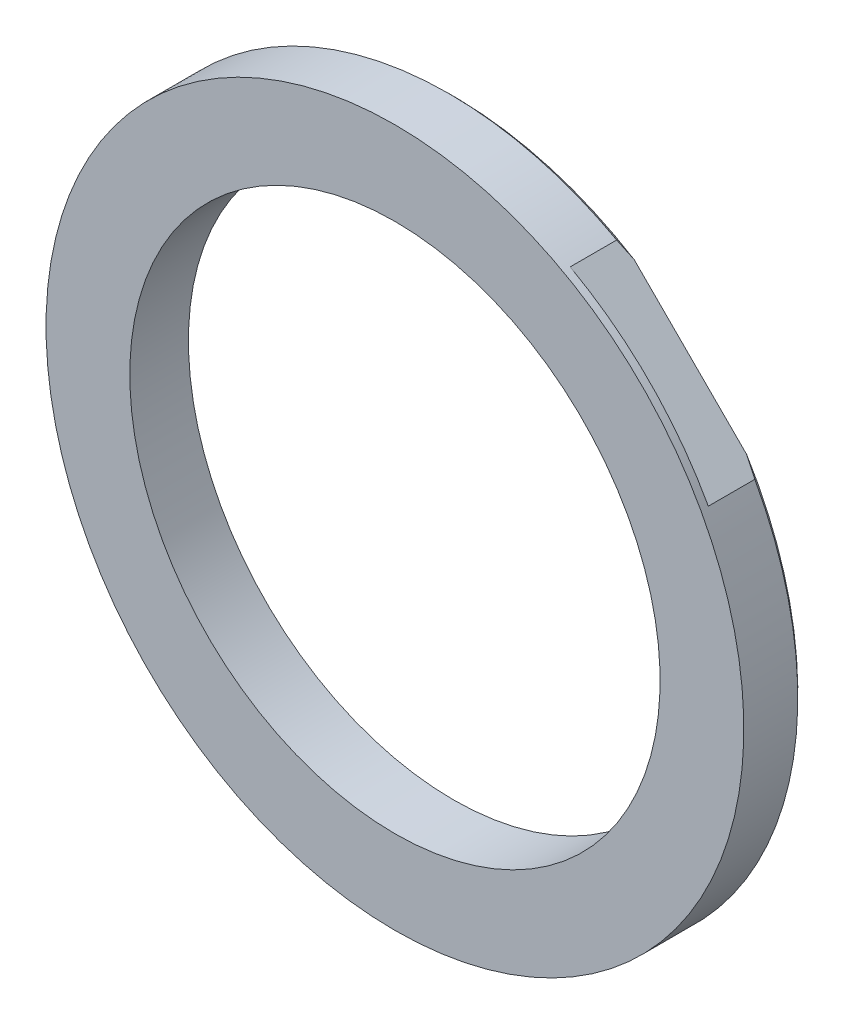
ISO-10303-21;
HEADER;
FILE_DESCRIPTION(('STEP AP214'),'2;1');
FILE_NAME('part.step','',(''),(''),'','','');
FILE_SCHEMA(('AUTOMOTIVE_DESIGN { 1 0 10303 214 1 1 1 1 }'));
ENDSEC;
DATA;
#1=APPLICATION_CONTEXT('core data for automotive mechanical design processes');
#2=APPLICATION_PROTOCOL_DEFINITION('international standard','automotive_design',2000,#1);
#3=PRODUCT_CONTEXT('',#1,'mechanical');
#4=PRODUCT('Part','Part','',(#3));
#5=PRODUCT_RELATED_PRODUCT_CATEGORY('part','',(#4));
#6=PRODUCT_DEFINITION_FORMATION('','',#4);
#7=PRODUCT_DEFINITION_CONTEXT('part definition',#1,'design');
#8=PRODUCT_DEFINITION('design','',#6,#7);
#9=PRODUCT_DEFINITION_SHAPE('','',#8);
#10=(LENGTH_UNIT() NAMED_UNIT(*) SI_UNIT(.MILLI.,.METRE.));
#11=(NAMED_UNIT(*) PLANE_ANGLE_UNIT() SI_UNIT($,.RADIAN.));
#12=(NAMED_UNIT(*) SI_UNIT($,.STERADIAN.) SOLID_ANGLE_UNIT());
#13=UNCERTAINTY_MEASURE_WITH_UNIT(LENGTH_MEASURE(1.E-05),#10,'distance_accuracy_value','');
#14=(GEOMETRIC_REPRESENTATION_CONTEXT(3) GLOBAL_UNCERTAINTY_ASSIGNED_CONTEXT((#13)) GLOBAL_UNIT_ASSIGNED_CONTEXT((#10,
#11,#12)) REPRESENTATION_CONTEXT('',''));
#15=CARTESIAN_POINT('',(0.,0.,0.));
#16=DIRECTION('',(0.,0.,1.));
#17=DIRECTION('',(1.,0.,0.));
#18=AXIS2_PLACEMENT_3D('',#15,#16,#17);
#19=CARTESIAN_POINT('',(-800.,0.,990.));
#20=DIRECTION('',(0.,0.,-1.));
#21=DIRECTION('',(0.,1.,0.));
#22=AXIS2_PLACEMENT_3D('',#19,#20,#21);
#23=PLANE('',#22);
#24=CARTESIAN_POINT('',(-800.,0.,990.));
#25=DIRECTION('',(0.,0.,1.));
#26=DIRECTION('',(1.,0.,0.));
#27=AXIS2_PLACEMENT_3D('',#24,#25,#26);
#28=CIRCLE('',#27,37.0000000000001);
#29=CARTESIAN_POINT('',(-819.414321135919,-31.4973671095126,990.));
#30=VERTEX_POINT('',#29);
#31=CARTESIAN_POINT('',(-768.502632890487,19.4143211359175,990.));
#32=VERTEX_POINT('',#31);
#33=EDGE_CURVE('E78',#30,#32,#28,.T.);
#34=ORIENTED_EDGE('',*,*,#33,.F.);
#35=DIRECTION('',(-0.707106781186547,0.707106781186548,0.));
#36=VECTOR('',#35,1.);
#37=CARTESIAN_POINT('',(-832.880465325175,-18.031222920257,990.));
#38=LINE('',#37,#36);
#39=CARTESIAN_POINT('',(-831.497367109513,-19.4143211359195,990.));
#40=VERTEX_POINT('',#39);
#41=EDGE_CURVE('E83',#30,#40,#38,.T.);
#42=ORIENTED_EDGE('',*,*,#41,.T.);
#43=CARTESIAN_POINT('',(-800.,0.,990.));
#44=DIRECTION('',(0.,0.,1.));
#45=DIRECTION('',(0.,-1.,0.));
#46=AXIS2_PLACEMENT_3D('',#43,#44,#45);
#47=CIRCLE('',#46,36.9999999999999);
#48=CARTESIAN_POINT('',(-780.585678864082,31.4973671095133,990.));
#49=VERTEX_POINT('',#48);
#50=EDGE_CURVE('E19',#49,#40,#47,.T.);
#51=ORIENTED_EDGE('',*,*,#50,.F.);
#52=DIRECTION('',(0.707106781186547,-0.707106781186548,0.));
#53=VECTOR('',#52,1.);
#54=CARTESIAN_POINT('',(-767.119534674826,18.031222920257,990.));
#55=LINE('',#54,#53);
#56=EDGE_CURVE('E67',#49,#32,#55,.T.);
#57=ORIENTED_EDGE('',*,*,#56,.T.);
#58=EDGE_LOOP('',(#34,#42,#51,#57));
#59=FACE_BOUND('',#58,.T.);
#60=CARTESIAN_POINT('',(-800.,0.,990.));
#61=DIRECTION('',(0.,0.,-1.));
#62=DIRECTION('',(0.,1.,0.));
#63=AXIS2_PLACEMENT_3D('',#60,#61,#62);
#64=CIRCLE('',#63,28.5);
#65=CARTESIAN_POINT('',(-800.,28.5,990.));
#66=VERTEX_POINT('',#65);
#67=EDGE_CURVE('E91',#66,#66,#64,.F.);
#68=ORIENTED_EDGE('',*,*,#67,.T.);
#69=EDGE_LOOP('',(#68));
#70=FACE_BOUND('',#69,.T.);
#71=ADVANCED_FACE('F16',(#59,#70),#23,.T.);
#72=CARTESIAN_POINT('',(-800.,0.,990.5));
#73=DIRECTION('',(0.,0.,1.));
#74=DIRECTION('',(0.,-1.,0.));
#75=AXIS2_PLACEMENT_3D('',#72,#73,#74);
#76=CONICAL_SURFACE('',#75,37.5000000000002,0.785398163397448);
#77=CARTESIAN_POINT('',(-781.968777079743,32.8804653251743,990.5));
#78=CARTESIAN_POINT('',(-781.854201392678,32.7658896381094,990.454630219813));
#79=CARTESIAN_POINT('',(-781.739447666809,32.6511359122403,990.410158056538));
#80=CARTESIAN_POINT('',(-781.509607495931,32.4212957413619,990.323056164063));
#81=CARTESIAN_POINT('',(-781.394521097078,32.3062093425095,990.280426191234));
#82=CARTESIAN_POINT('',(-781.164008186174,32.0756964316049,990.197043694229));
#83=CARTESIAN_POINT('',(-781.048581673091,31.9602699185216,990.156291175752));
#84=CARTESIAN_POINT('',(-780.81738318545,31.7290714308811,990.07669904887));
#85=CARTESIAN_POINT('',(-780.701611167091,31.6132994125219,990.037859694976));
#86=CARTESIAN_POINT('',(-780.585678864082,31.497367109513,990.));
#87=B_SPLINE_CURVE_WITH_KNOTS('',3,(#77,#78,#79,#80,#81,#82,#83,#84,#85,#86),.UNSPECIFIED.,.F.,
.F.,(4,2,2,2,4),(0.,0.504797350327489,1.0095277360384,1.51425965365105,2.01905853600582),.UNSPECIFIED.);
#88=CARTESIAN_POINT('',(-781.968777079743,32.8804653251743,990.5));
#89=VERTEX_POINT('',#88);
#90=EDGE_CURVE('E72',#89,#49,#87,.T.);
#91=ORIENTED_EDGE('',*,*,#90,.T.);
#92=ORIENTED_EDGE('',*,*,#50,.T.);
#93=CARTESIAN_POINT('',(-831.497367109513,-19.4143211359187,990.));
#94=CARTESIAN_POINT('',(-831.613299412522,-19.2983888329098,990.037859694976));
#95=CARTESIAN_POINT('',(-831.729071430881,-19.1826168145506,990.076699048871));
#96=CARTESIAN_POINT('',(-831.960269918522,-18.95141832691,990.156291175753));
#97=CARTESIAN_POINT('',(-832.075696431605,-18.8359918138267,990.19704369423));
#98=CARTESIAN_POINT('',(-832.30620934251,-18.605478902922,990.280426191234));
#99=CARTESIAN_POINT('',(-832.421295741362,-18.4903925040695,990.323056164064));
#100=CARTESIAN_POINT('',(-832.651135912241,-18.2605523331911,990.410158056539));
#101=CARTESIAN_POINT('',(-832.76588963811,-18.145798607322,990.454630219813));
#102=CARTESIAN_POINT('',(-832.880465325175,-18.0312229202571,990.5));
#103=B_SPLINE_CURVE_WITH_KNOTS('',3,(#93,#94,#95,#96,#97,#98,#99,#100,#101,#102),.UNSPECIFIED.,
.F.,.F.,(4,2,2,2,4),(0.,0.504798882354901,1.00953079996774,1.51426118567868,2.01905853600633),.UNSPECIFIED.);
#104=CARTESIAN_POINT('',(-832.880465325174,-18.0312229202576,990.5));
#105=VERTEX_POINT('',#104);
#106=EDGE_CURVE('E119',#40,#105,#103,.T.);
#107=ORIENTED_EDGE('',*,*,#106,.T.);
#108=CARTESIAN_POINT('',(-800.,0.,990.5));
#109=DIRECTION('',(0.,0.,-1.));
#110=DIRECTION('',(0.,1.,0.));
#111=AXIS2_PLACEMENT_3D('',#108,#109,#110);
#112=CIRCLE('',#111,37.5);
#113=EDGE_CURVE('E90',#89,#105,#112,.F.);
#114=ORIENTED_EDGE('',*,*,#113,.F.);
#115=EDGE_LOOP('',(#91,#92,#107,#114));
#116=FACE_BOUND('',#115,.T.);
#117=ADVANCED_FACE('F89',(#116),#76,.T.);
#118=CARTESIAN_POINT('',(-825.7757695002,-25.7757695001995,995.5));
#119=DIRECTION('',(0.,0.,1.));
#120=DIRECTION('',(0.,-1.,0.));
#121=AXIS2_PLACEMENT_3D('',#118,#119,#120);
#122=PLANE('',#121);
#123=CARTESIAN_POINT('',(-800.,0.,995.5));
#124=DIRECTION('',(0.,0.,-1.));
#125=DIRECTION('',(0.,1.,0.));
#126=AXIS2_PLACEMENT_3D('',#123,#124,#125);
#127=CIRCLE('',#126,37.5);
#128=CARTESIAN_POINT('',(-832.880465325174,-18.0312229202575,995.5));
#129=VERTEX_POINT('',#128);
#130=CARTESIAN_POINT('',(-818.031222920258,-32.8804653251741,995.5));
#131=VERTEX_POINT('',#130);
#132=EDGE_CURVE('E151',#129,#131,#127,.F.);
#133=ORIENTED_EDGE('',*,*,#132,.F.);
#134=DIRECTION('',(-0.707106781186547,0.707106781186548,0.));
#135=VECTOR('',#134,1.);
#136=CARTESIAN_POINT('',(-832.880465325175,-18.031222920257,995.5));
#137=LINE('',#136,#135);
#138=EDGE_CURVE('E87',#129,#131,#137,.F.);
#139=ORIENTED_EDGE('',*,*,#138,.T.);
#140=EDGE_LOOP('',(#133,#139));
#141=FACE_BOUND('',#140,.T.);
#142=ADVANCED_FACE('F116',(#141),#122,.F.);
#143=CARTESIAN_POINT('',(-832.880465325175,-18.031222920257,990.));
#144=DIRECTION('',(0.707106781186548,0.707106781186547,0.));
#145=DIRECTION('',(-0.707106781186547,0.707106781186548,0.));
#146=AXIS2_PLACEMENT_3D('',#143,#144,#145);
#147=PLANE('',#146);
#148=ORIENTED_EDGE('',*,*,#41,.F.);
#149=CARTESIAN_POINT('',(-819.414321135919,-31.4973671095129,990.));
#150=CARTESIAN_POINT('',(-819.356779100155,-31.5549097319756,990.018791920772));
#151=CARTESIAN_POINT('',(-819.299276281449,-31.6124128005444,990.037824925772));
#152=CARTESIAN_POINT('',(-819.184242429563,-31.7274467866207,990.076404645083));
#153=CARTESIAN_POINT('',(-819.126711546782,-31.7849775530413,990.095952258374));
#154=CARTESIAN_POINT('',(-819.011617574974,-31.9000712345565,990.135561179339));
#155=CARTESIAN_POINT('',(-818.954054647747,-31.9576339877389,990.155623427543));
#156=CARTESIAN_POINT('',(-818.838892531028,-32.0727958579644,990.196261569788));
#157=CARTESIAN_POINT('',(-818.78129351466,-32.1303948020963,990.216838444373));
#158=CARTESIAN_POINT('',(-818.666055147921,-32.2456331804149,990.258505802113));
#159=CARTESIAN_POINT('',(-818.608415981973,-32.3032724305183,990.27959730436));
#160=CARTESIAN_POINT('',(-818.493093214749,-32.4185954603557,990.32229387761));
#161=CARTESIAN_POINT('',(-818.4354098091,-32.476279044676,990.343900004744));
#162=CARTESIAN_POINT('',(-818.319994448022,-32.5916946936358,990.387625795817));
#163=CARTESIAN_POINT('',(-818.262262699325,-32.6494265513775,990.409746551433));
#164=CARTESIAN_POINT('',(-818.146746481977,-32.764942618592,990.454501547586));
#165=CARTESIAN_POINT('',(-818.088962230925,-32.8227266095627,990.477136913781));
#166=CARTESIAN_POINT('',(-818.031222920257,-32.8804653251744,990.5));
#167=B_SPLINE_CURVE_WITH_KNOTS('',3,(#149,#150,#151,#152,#153,#154,#155,#156,#157,#158,#159,
#160,#161,#162,#163,#164,#165,#166),.UNSPECIFIED.,.F.,.F.,(4,2,2,2,2,2,2,2,4),(0.,
0.25055573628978,0.50158278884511,0.753106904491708,1.00515358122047,1.25774806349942,
1.51091533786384,1.76468012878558,2.01906689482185),.UNSPECIFIED.);
#168=CARTESIAN_POINT('',(-818.031222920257,-32.8804653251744,990.5));
#169=VERTEX_POINT('',#168);
#170=EDGE_CURVE('E124',#169,#30,#167,.F.);
#171=ORIENTED_EDGE('',*,*,#170,.F.);
#172=DIRECTION('',(0.,0.,-1.));
#173=VECTOR('',#172,1.);
#174=CARTESIAN_POINT('',(-818.031222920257,-32.8804653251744,996.3));
#175=LINE('',#174,#173);
#176=EDGE_CURVE('E152',#131,#169,#175,.T.);
#177=ORIENTED_EDGE('',*,*,#176,.F.);
#178=ORIENTED_EDGE('',*,*,#138,.F.);
#179=DIRECTION('',(0.,0.,-1.));
#180=VECTOR('',#179,1.);
#181=CARTESIAN_POINT('',(-832.880465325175,-18.0312229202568,996.3));
#182=LINE('',#181,#180);
#183=EDGE_CURVE('E139',#105,#129,#182,.F.);
#184=ORIENTED_EDGE('',*,*,#183,.F.);
#185=ORIENTED_EDGE('',*,*,#106,.F.);
#186=EDGE_LOOP('',(#148,#171,#177,#178,#184,#185));
#187=FACE_BOUND('',#186,.T.);
#188=ADVANCED_FACE('F125',(#187),#147,.F.);
#189=CARTESIAN_POINT('',(-800.,0.,990.5));
#190=DIRECTION('',(0.,0.,1.));
#191=DIRECTION('',(1.,0.,0.));
#192=AXIS2_PLACEMENT_3D('',#189,#190,#191);
#193=CONICAL_SURFACE('',#192,37.5,0.785398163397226);
#194=ORIENTED_EDGE('',*,*,#170,.T.);
#195=ORIENTED_EDGE('',*,*,#33,.T.);
#196=CARTESIAN_POINT('',(-768.502632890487,19.4143211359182,990.));
#197=CARTESIAN_POINT('',(-768.386700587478,19.2983888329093,990.037859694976));
#198=CARTESIAN_POINT('',(-768.270928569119,19.1826168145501,990.07669904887));
#199=CARTESIAN_POINT('',(-768.039730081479,18.9514183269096,990.156291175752));
#200=CARTESIAN_POINT('',(-767.924303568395,18.8359918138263,990.197043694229));
#201=CARTESIAN_POINT('',(-767.693790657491,18.6054789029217,990.280426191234));
#202=CARTESIAN_POINT('',(-767.578704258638,18.4903925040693,990.323056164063));
#203=CARTESIAN_POINT('',(-767.34886408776,18.260552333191,990.410158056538));
#204=CARTESIAN_POINT('',(-767.234110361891,18.1457986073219,990.454630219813));
#205=CARTESIAN_POINT('',(-767.119534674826,18.031222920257,990.5));
#206=B_SPLINE_CURVE_WITH_KNOTS('',3,(#196,#197,#198,#199,#200,#201,#202,#203,#204,#205),
.UNSPECIFIED.,.F.,.F.,(4,2,2,2,4),(0.,0.504798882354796,1.00953079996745,1.51426118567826,
2.01905853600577),.UNSPECIFIED.);
#207=CARTESIAN_POINT('',(-767.119534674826,18.0312229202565,990.5));
#208=VERTEX_POINT('',#207);
#209=EDGE_CURVE('E75',#32,#208,#206,.T.);
#210=ORIENTED_EDGE('',*,*,#209,.T.);
#211=CARTESIAN_POINT('',(-800.,0.,990.5));
#212=DIRECTION('',(0.,0.,-1.));
#213=DIRECTION('',(0.,1.,0.));
#214=AXIS2_PLACEMENT_3D('',#211,#212,#213);
#215=CIRCLE('',#214,37.5);
#216=EDGE_CURVE('E156',#169,#208,#215,.F.);
#217=ORIENTED_EDGE('',*,*,#216,.F.);
#218=EDGE_LOOP('',(#194,#195,#210,#217));
#219=FACE_BOUND('',#218,.T.);
#220=ADVANCED_FACE('F128',(#219),#193,.T.);
#221=CARTESIAN_POINT('',(-774.224230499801,25.7757695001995,995.5));
#222=DIRECTION('',(0.,0.,1.));
#223=DIRECTION('',(0.,-1.,0.));
#224=AXIS2_PLACEMENT_3D('',#221,#222,#223);
#225=PLANE('',#224);
#226=DIRECTION('',(0.707106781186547,-0.707106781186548,0.));
#227=VECTOR('',#226,1.);
#228=CARTESIAN_POINT('',(-767.119534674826,18.031222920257,995.5));
#229=LINE('',#228,#227);
#230=CARTESIAN_POINT('',(-767.119534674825,18.0312229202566,995.5));
#231=VERTEX_POINT('',#230);
#232=CARTESIAN_POINT('',(-781.968777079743,32.8804653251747,995.5));
#233=VERTEX_POINT('',#232);
#234=EDGE_CURVE('E92',#231,#233,#229,.F.);
#235=ORIENTED_EDGE('',*,*,#234,.T.);
#236=CARTESIAN_POINT('',(-800.,0.,995.5));
#237=DIRECTION('',(0.,0.,-1.));
#238=DIRECTION('',(0.,1.,0.));
#239=AXIS2_PLACEMENT_3D('',#236,#237,#238);
#240=CIRCLE('',#239,37.5);
#241=EDGE_CURVE('E34',#231,#233,#240,.F.);
#242=ORIENTED_EDGE('',*,*,#241,.F.);
#243=EDGE_LOOP('',(#235,#242));
#244=FACE_BOUND('',#243,.T.);
#245=ADVANCED_FACE('F132',(#244),#225,.F.);
#246=CARTESIAN_POINT('',(-767.119534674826,18.031222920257,990.));
#247=DIRECTION('',(-0.707106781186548,-0.707106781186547,0.));
#248=DIRECTION('',(0.707106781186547,-0.707106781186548,0.));
#249=AXIS2_PLACEMENT_3D('',#246,#247,#248);
#250=PLANE('',#249);
#251=DIRECTION('',(0.,0.,-1.));
#252=VECTOR('',#251,1.);
#253=CARTESIAN_POINT('',(-781.968777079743,32.8804653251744,996.3));
#254=LINE('',#253,#252);
#255=EDGE_CURVE('E149',#233,#89,#254,.T.);
#256=ORIENTED_EDGE('',*,*,#255,.F.);
#257=ORIENTED_EDGE('',*,*,#234,.F.);
#258=DIRECTION('',(0.,0.,-1.));
#259=VECTOR('',#258,1.);
#260=CARTESIAN_POINT('',(-767.119534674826,18.0312229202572,996.3));
#261=LINE('',#260,#259);
#262=EDGE_CURVE('E150',#208,#231,#261,.F.);
#263=ORIENTED_EDGE('',*,*,#262,.F.);
#264=ORIENTED_EDGE('',*,*,#209,.F.);
#265=ORIENTED_EDGE('',*,*,#56,.F.);
#266=ORIENTED_EDGE('',*,*,#90,.F.);
#267=EDGE_LOOP('',(#256,#257,#263,#264,#265,#266));
#268=FACE_BOUND('',#267,.T.);
#269=ADVANCED_FACE('F70',(#268),#250,.F.);
#270=CARTESIAN_POINT('',(-800.,0.,996.3));
#271=DIRECTION('',(0.,0.,-1.));
#272=DIRECTION('',(0.,1.,0.));
#273=AXIS2_PLACEMENT_3D('',#270,#271,#272);
#274=CYLINDRICAL_SURFACE('',#273,28.5);
#275=CARTESIAN_POINT('',(-800.,0.,996.3));
#276=DIRECTION('',(0.,0.,-1.));
#277=DIRECTION('',(0.,1.,0.));
#278=AXIS2_PLACEMENT_3D('',#275,#276,#277);
#279=CIRCLE('',#278,28.5);
#280=CARTESIAN_POINT('',(-800.,28.5,996.3));
#281=VERTEX_POINT('',#280);
#282=EDGE_CURVE('E25',#281,#281,#279,.F.);
#283=ORIENTED_EDGE('',*,*,#282,.T.);
#284=EDGE_LOOP('',(#283));
#285=FACE_BOUND('',#284,.T.);
#286=ORIENTED_EDGE('',*,*,#67,.F.);
#287=EDGE_LOOP('',(#286));
#288=FACE_BOUND('',#287,.T.);
#289=ADVANCED_FACE('F175',(#285,#288),#274,.F.);
#290=CARTESIAN_POINT('',(-800.,0.,996.3));
#291=DIRECTION('',(0.,0.,-1.));
#292=DIRECTION('',(0.,1.,0.));
#293=AXIS2_PLACEMENT_3D('',#290,#291,#292);
#294=CYLINDRICAL_SURFACE('',#293,37.5);
#295=CARTESIAN_POINT('',(-800.,0.,996.3));
#296=DIRECTION('',(0.,0.,-1.));
#297=DIRECTION('',(0.,1.,0.));
#298=AXIS2_PLACEMENT_3D('',#295,#296,#297);
#299=CIRCLE('',#298,37.5);
#300=CARTESIAN_POINT('',(-800.,37.5,996.3));
#301=VERTEX_POINT('',#300);
#302=EDGE_CURVE('E10',#301,#301,#299,.T.);
#303=ORIENTED_EDGE('',*,*,#302,.T.);
#304=EDGE_LOOP('',(#303));
#305=FACE_BOUND('',#304,.T.);
#306=ORIENTED_EDGE('',*,*,#241,.T.);
#307=ORIENTED_EDGE('',*,*,#255,.T.);
#308=ORIENTED_EDGE('',*,*,#113,.T.);
#309=ORIENTED_EDGE('',*,*,#183,.T.);
#310=ORIENTED_EDGE('',*,*,#132,.T.);
#311=ORIENTED_EDGE('',*,*,#176,.T.);
#312=ORIENTED_EDGE('',*,*,#216,.T.);
#313=ORIENTED_EDGE('',*,*,#262,.T.);
#314=EDGE_LOOP('',(#306,#307,#308,#309,#310,#311,#312,#313));
#315=FACE_BOUND('',#314,.T.);
#316=ADVANCED_FACE('F168',(#305,#315),#294,.T.);
#317=CARTESIAN_POINT('',(-800.,0.,996.3));
#318=DIRECTION('',(0.,0.,-1.));
#319=DIRECTION('',(0.,1.,0.));
#320=AXIS2_PLACEMENT_3D('',#317,#318,#319);
#321=PLANE('',#320);
#322=ORIENTED_EDGE('',*,*,#302,.F.);
#323=EDGE_LOOP('',(#322));
#324=FACE_BOUND('',#323,.T.);
#325=ORIENTED_EDGE('',*,*,#282,.F.);
#326=EDGE_LOOP('',(#325));
#327=FACE_BOUND('',#326,.T.);
#328=ADVANCED_FACE('F176',(#324,#327),#321,.F.);
#329=CLOSED_SHELL('',(#71,#117,#142,#188,#220,#245,#269,#289,#316,#328));
#330=MANIFOLD_SOLID_BREP('B1',#329);
#331=ADVANCED_BREP_SHAPE_REPRESENTATION('',(#18,#330),#14);
#332=SHAPE_DEFINITION_REPRESENTATION(#9,#331);
ENDSEC;
END-ISO-10303-21;
